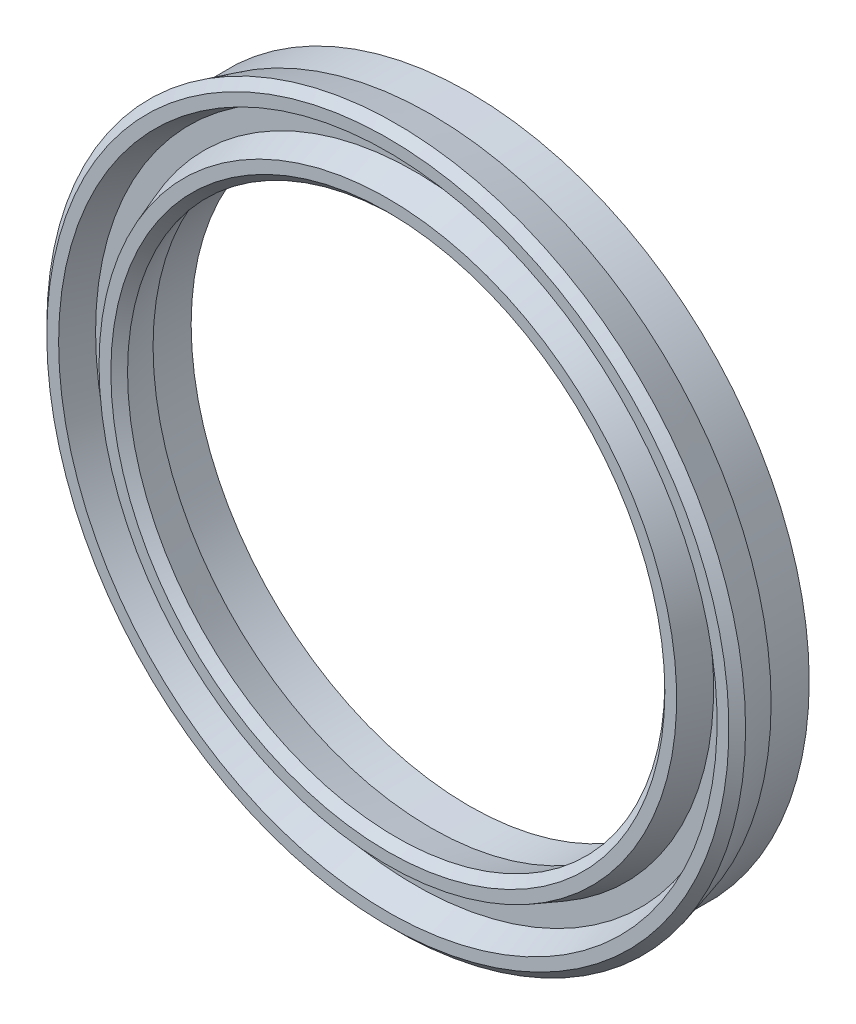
from build123d import *


with BuildPart() as part:
    # Sketch1 → Body (revolve)
    with BuildSketch(Plane(origin=(-63.6, 0, -73.557122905), x_dir=(-1, 0, 0), z_dir=(0, 1, 0)), mode=Mode.PRIVATE) as body_sk:
        Polygon((-114.2, 58.757122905), (-125.5, 58.757122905), (-125.5, 65.692025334), (-127.2, 72.036511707), (-125.679388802, 73.557122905), (-123.528919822, 73.557122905), (-121.733333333, 68.623789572), (-117.966666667, 68.623789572), (-116.171080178, 73.557122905), (-114.020611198, 73.557122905), (-112.5, 72.036511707), (-114.2, 65.692025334), align=None)
    revolve(body_sk.sketch.rotate(Axis((0, 0, -14.8), (0, 0, 1)), 180), axis=Axis((0, 0, -14.8), (0, 0, 1)))


solid = part.part
